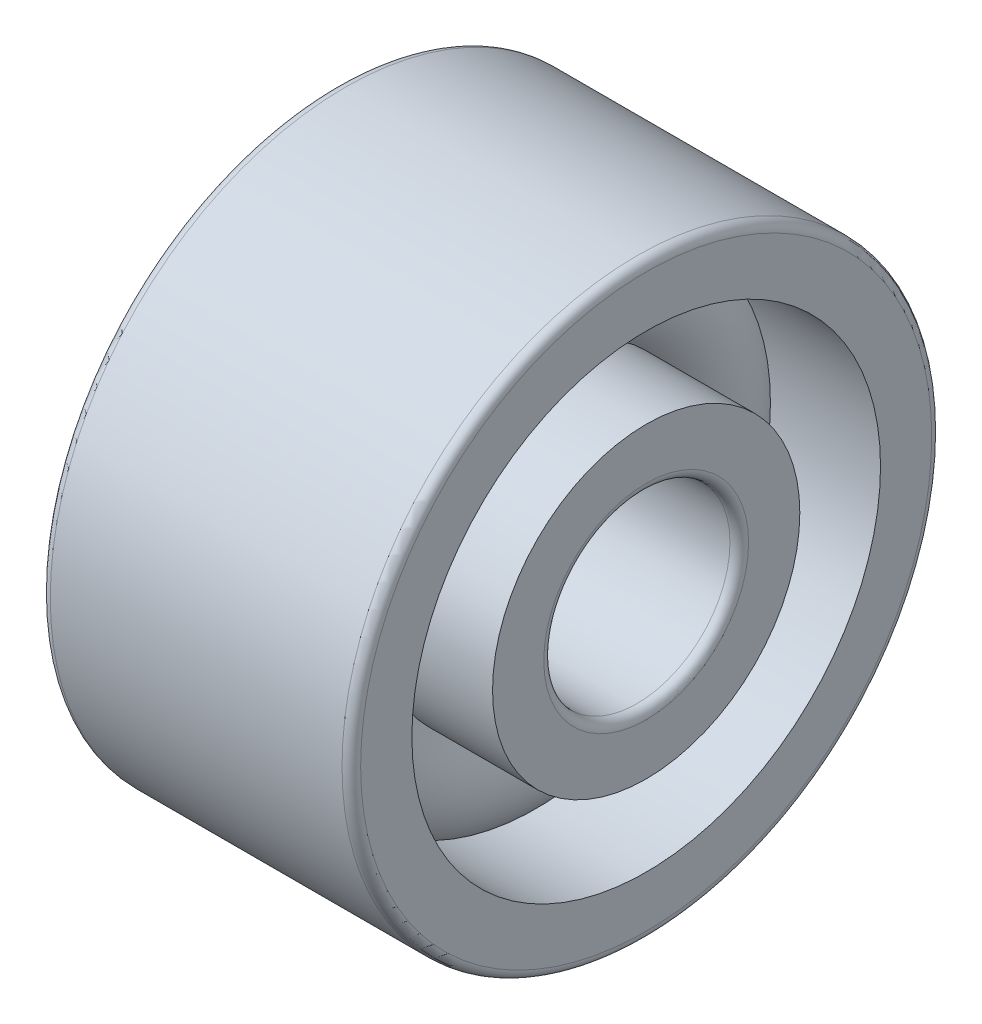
ISO-10303-21;
HEADER;
FILE_DESCRIPTION(('STEP AP214'),'2;1');
FILE_NAME('part.step','',(''),(''),'','','');
FILE_SCHEMA(('AUTOMOTIVE_DESIGN { 1 0 10303 214 1 1 1 1 }'));
ENDSEC;
DATA;
#1=APPLICATION_CONTEXT('core data for automotive mechanical design processes');
#2=APPLICATION_PROTOCOL_DEFINITION('international standard','automotive_design',2000,#1);
#3=PRODUCT_CONTEXT('',#1,'mechanical');
#4=PRODUCT('Part','Part','',(#3));
#5=PRODUCT_RELATED_PRODUCT_CATEGORY('part','',(#4));
#6=PRODUCT_DEFINITION_FORMATION('','',#4);
#7=PRODUCT_DEFINITION_CONTEXT('part definition',#1,'design');
#8=PRODUCT_DEFINITION('design','',#6,#7);
#9=PRODUCT_DEFINITION_SHAPE('','',#8);
#10=(LENGTH_UNIT() NAMED_UNIT(*) SI_UNIT(.MILLI.,.METRE.));
#11=(NAMED_UNIT(*) PLANE_ANGLE_UNIT() SI_UNIT($,.RADIAN.));
#12=(NAMED_UNIT(*) SI_UNIT($,.STERADIAN.) SOLID_ANGLE_UNIT());
#13=UNCERTAINTY_MEASURE_WITH_UNIT(LENGTH_MEASURE(1.E-05),#10,'distance_accuracy_value','');
#14=(GEOMETRIC_REPRESENTATION_CONTEXT(3) GLOBAL_UNCERTAINTY_ASSIGNED_CONTEXT((#13)) GLOBAL_UNIT_ASSIGNED_CONTEXT((#10,
#11,#12)) REPRESENTATION_CONTEXT('',''));
#15=CARTESIAN_POINT('',(0.,0.,0.));
#16=DIRECTION('',(0.,0.,1.));
#17=DIRECTION('',(1.,0.,0.));
#18=AXIS2_PLACEMENT_3D('',#15,#16,#17);
#19=CARTESIAN_POINT('',(0.,0.,0.));
#20=DIRECTION('',(-1.,0.,0.));
#21=DIRECTION('',(0.,0.,1.));
#22=AXIS2_PLACEMENT_3D('',#19,#20,#21);
#23=TOROIDAL_SURFACE('',#22,6.25,1.95);
#24=CARTESIAN_POINT('',(1.45344418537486,0.,0.));
#25=DIRECTION('',(-1.,0.,0.));
#26=DIRECTION('',(0.,0.,1.));
#27=AXIS2_PLACEMENT_3D('',#24,#25,#26);
#28=CIRCLE('',#27,7.55);
#29=CARTESIAN_POINT('',(1.45344418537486,0.,7.55));
#30=VERTEX_POINT('',#29);
#31=EDGE_CURVE('E36',#30,#30,#28,.F.);
#32=ORIENTED_EDGE('',*,*,#31,.T.);
#33=EDGE_LOOP('',(#32));
#34=FACE_BOUND('',#33,.T.);
#35=CARTESIAN_POINT('',(1.45344418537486,0.,0.));
#36=DIRECTION('',(-1.,0.,0.));
#37=DIRECTION('',(0.,0.,1.));
#38=AXIS2_PLACEMENT_3D('',#35,#36,#37);
#39=CIRCLE('',#38,4.95);
#40=CARTESIAN_POINT('',(1.45344418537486,0.,4.95));
#41=VERTEX_POINT('',#40);
#42=EDGE_CURVE('E10',#41,#41,#39,.T.);
#43=ORIENTED_EDGE('',*,*,#42,.T.);
#44=EDGE_LOOP('',(#43));
#45=FACE_BOUND('',#44,.T.);
#46=ADVANCED_FACE('F32',(#34,#45),#23,.T.);
#47=CARTESIAN_POINT('',(-20.6375,0.,0.));
#48=DIRECTION('',(1.,0.,0.));
#49=DIRECTION('',(0.,0.,-1.));
#50=AXIS2_PLACEMENT_3D('',#47,#48,#49);
#51=CYLINDRICAL_SURFACE('',#50,4.95);
#52=CARTESIAN_POINT('',(5.,0.,0.));
#53=DIRECTION('',(1.,0.,0.));
#54=DIRECTION('',(0.,0.,-1.));
#55=AXIS2_PLACEMENT_3D('',#52,#53,#54);
#56=CIRCLE('',#55,4.95);
#57=CARTESIAN_POINT('',(5.,0.,-4.95));
#58=VERTEX_POINT('',#57);
#59=EDGE_CURVE('E45',#58,#58,#56,.T.);
#60=ORIENTED_EDGE('',*,*,#59,.F.);
#61=EDGE_LOOP('',(#60));
#62=FACE_BOUND('',#61,.T.);
#63=ORIENTED_EDGE('',*,*,#42,.F.);
#64=EDGE_LOOP('',(#63));
#65=FACE_BOUND('',#64,.T.);
#66=ADVANCED_FACE('F84',(#62,#65),#51,.T.);
#67=CARTESIAN_POINT('',(-20.6375,0.,0.));
#68=DIRECTION('',(1.,0.,0.));
#69=DIRECTION('',(0.,0.,-1.));
#70=AXIS2_PLACEMENT_3D('',#67,#68,#69);
#71=CYLINDRICAL_SURFACE('',#70,4.95);
#72=CARTESIAN_POINT('',(-5.,0.,0.));
#73=DIRECTION('',(1.,0.,0.));
#74=DIRECTION('',(0.,0.,-1.));
#75=AXIS2_PLACEMENT_3D('',#72,#73,#74);
#76=CIRCLE('',#75,4.95);
#77=CARTESIAN_POINT('',(-5.,0.,-4.95));
#78=VERTEX_POINT('',#77);
#79=EDGE_CURVE('E54',#78,#78,#76,.T.);
#80=ORIENTED_EDGE('',*,*,#79,.T.);
#81=EDGE_LOOP('',(#80));
#82=FACE_BOUND('',#81,.T.);
#83=CARTESIAN_POINT('',(-1.45344418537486,0.,0.));
#84=DIRECTION('',(1.,0.,0.));
#85=DIRECTION('',(0.,0.,-1.));
#86=AXIS2_PLACEMENT_3D('',#83,#84,#85);
#87=CIRCLE('',#86,4.95);
#88=CARTESIAN_POINT('',(-1.45344418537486,0.,-4.95));
#89=VERTEX_POINT('',#88);
#90=EDGE_CURVE('E40',#89,#89,#87,.T.);
#91=ORIENTED_EDGE('',*,*,#90,.F.);
#92=EDGE_LOOP('',(#91));
#93=FACE_BOUND('',#92,.T.);
#94=ADVANCED_FACE('F87',(#82,#93),#71,.T.);
#95=CARTESIAN_POINT('',(5.,3.3,0.));
#96=DIRECTION('',(1.,0.,0.));
#97=DIRECTION('',(0.,0.,-1.));
#98=AXIS2_PLACEMENT_3D('',#95,#96,#97);
#99=PLANE('',#98);
#100=ORIENTED_EDGE('',*,*,#59,.T.);
#101=EDGE_LOOP('',(#100));
#102=FACE_BOUND('',#101,.T.);
#103=CARTESIAN_POINT('',(5.,0.,0.));
#104=DIRECTION('',(1.,0.,0.));
#105=DIRECTION('',(0.,0.,-1.));
#106=AXIS2_PLACEMENT_3D('',#103,#104,#105);
#107=CIRCLE('',#106,3.3);
#108=CARTESIAN_POINT('',(5.,0.,-3.3));
#109=VERTEX_POINT('',#108);
#110=EDGE_CURVE('E76',#109,#109,#107,.T.);
#111=ORIENTED_EDGE('',*,*,#110,.F.);
#112=EDGE_LOOP('',(#111));
#113=FACE_BOUND('',#112,.T.);
#114=ADVANCED_FACE('F81',(#102,#113),#99,.T.);
#115=CARTESIAN_POINT('',(4.7,0.,0.));
#116=DIRECTION('',(1.,0.,0.));
#117=DIRECTION('',(0.,0.,-1.));
#118=AXIS2_PLACEMENT_3D('',#115,#116,#117);
#119=TOROIDAL_SURFACE('',#118,3.3,0.3);
#120=ORIENTED_EDGE('',*,*,#110,.T.);
#121=EDGE_LOOP('',(#120));
#122=FACE_BOUND('',#121,.T.);
#123=CARTESIAN_POINT('',(4.7,0.,0.));
#124=DIRECTION('',(1.,0.,0.));
#125=DIRECTION('',(0.,0.,-1.));
#126=AXIS2_PLACEMENT_3D('',#123,#124,#125);
#127=CIRCLE('',#126,3.);
#128=CARTESIAN_POINT('',(4.7,0.,-3.));
#129=VERTEX_POINT('',#128);
#130=EDGE_CURVE('E73',#129,#129,#127,.T.);
#131=ORIENTED_EDGE('',*,*,#130,.F.);
#132=EDGE_LOOP('',(#131));
#133=FACE_BOUND('',#132,.T.);
#134=ADVANCED_FACE('F98',(#122,#133),#119,.T.);
#135=CARTESIAN_POINT('',(-20.6375,0.,0.));
#136=DIRECTION('',(1.,0.,0.));
#137=DIRECTION('',(0.,0.,-1.));
#138=AXIS2_PLACEMENT_3D('',#135,#136,#137);
#139=CYLINDRICAL_SURFACE('',#138,3.);
#140=ORIENTED_EDGE('',*,*,#130,.T.);
#141=EDGE_LOOP('',(#140));
#142=FACE_BOUND('',#141,.T.);
#143=CARTESIAN_POINT('',(-4.7,0.,0.));
#144=DIRECTION('',(1.,0.,0.));
#145=DIRECTION('',(0.,0.,-1.));
#146=AXIS2_PLACEMENT_3D('',#143,#144,#145);
#147=CIRCLE('',#146,3.);
#148=CARTESIAN_POINT('',(-4.7,0.,-3.));
#149=VERTEX_POINT('',#148);
#150=EDGE_CURVE('E70',#149,#149,#147,.T.);
#151=ORIENTED_EDGE('',*,*,#150,.F.);
#152=EDGE_LOOP('',(#151));
#153=FACE_BOUND('',#152,.T.);
#154=ADVANCED_FACE('F101',(#142,#153),#139,.F.);
#155=CARTESIAN_POINT('',(-4.7,0.,0.));
#156=DIRECTION('',(1.,0.,0.));
#157=DIRECTION('',(0.,0.,-1.));
#158=AXIS2_PLACEMENT_3D('',#155,#156,#157);
#159=TOROIDAL_SURFACE('',#158,3.3,0.3);
#160=ORIENTED_EDGE('',*,*,#150,.T.);
#161=EDGE_LOOP('',(#160));
#162=FACE_BOUND('',#161,.T.);
#163=CARTESIAN_POINT('',(-5.,0.,0.));
#164=DIRECTION('',(1.,0.,0.));
#165=DIRECTION('',(0.,0.,-1.));
#166=AXIS2_PLACEMENT_3D('',#163,#164,#165);
#167=CIRCLE('',#166,3.3);
#168=CARTESIAN_POINT('',(-5.,0.,-3.3));
#169=VERTEX_POINT('',#168);
#170=EDGE_CURVE('E67',#169,#169,#167,.T.);
#171=ORIENTED_EDGE('',*,*,#170,.F.);
#172=EDGE_LOOP('',(#171));
#173=FACE_BOUND('',#172,.T.);
#174=ADVANCED_FACE('F105',(#162,#173),#159,.T.);
#175=CARTESIAN_POINT('',(-5.,4.95,0.));
#176=DIRECTION('',(-1.,0.,0.));
#177=DIRECTION('',(0.,0.,1.));
#178=AXIS2_PLACEMENT_3D('',#175,#176,#177);
#179=PLANE('',#178);
#180=ORIENTED_EDGE('',*,*,#170,.T.);
#181=EDGE_LOOP('',(#180));
#182=FACE_BOUND('',#181,.T.);
#183=ORIENTED_EDGE('',*,*,#79,.F.);
#184=EDGE_LOOP('',(#183));
#185=FACE_BOUND('',#184,.T.);
#186=ADVANCED_FACE('F109',(#182,#185),#179,.T.);
#187=CARTESIAN_POINT('',(-1.45344418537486,0.,0.));
#188=DIRECTION('',(1.,0.,0.));
#189=DIRECTION('',(0.,0.,-1.));
#190=AXIS2_PLACEMENT_3D('',#187,#188,#189);
#191=CIRCLE('',#190,7.55);
#192=CARTESIAN_POINT('',(-1.45344418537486,0.,-7.55));
#193=VERTEX_POINT('',#192);
#194=EDGE_CURVE('E48',#193,#193,#191,.F.);
#195=ORIENTED_EDGE('',*,*,#194,.T.);
#196=EDGE_LOOP('',(#195));
#197=FACE_BOUND('',#196,.T.);
#198=ORIENTED_EDGE('',*,*,#90,.T.);
#199=EDGE_LOOP('',(#198));
#200=FACE_BOUND('',#199,.T.);
#201=ADVANCED_FACE('F34',(#197,#200),#23,.T.);
#202=CARTESIAN_POINT('',(-20.6375,0.,0.));
#203=DIRECTION('',(1.,0.,0.));
#204=DIRECTION('',(0.,0.,-1.));
#205=AXIS2_PLACEMENT_3D('',#202,#203,#204);
#206=CYLINDRICAL_SURFACE('',#205,7.55);
#207=CARTESIAN_POINT('',(5.,0.,0.));
#208=DIRECTION('',(1.,0.,0.));
#209=DIRECTION('',(0.,0.,-1.));
#210=AXIS2_PLACEMENT_3D('',#207,#208,#209);
#211=CIRCLE('',#210,7.55);
#212=CARTESIAN_POINT('',(5.,0.,-7.55));
#213=VERTEX_POINT('',#212);
#214=EDGE_CURVE('E50',#213,#213,#211,.T.);
#215=ORIENTED_EDGE('',*,*,#214,.T.);
#216=EDGE_LOOP('',(#215));
#217=FACE_BOUND('',#216,.T.);
#218=ORIENTED_EDGE('',*,*,#31,.F.);
#219=EDGE_LOOP('',(#218));
#220=FACE_BOUND('',#219,.T.);
#221=ADVANCED_FACE('F114',(#217,#220),#206,.F.);
#222=CARTESIAN_POINT('',(-20.6375,0.,0.));
#223=DIRECTION('',(1.,0.,0.));
#224=DIRECTION('',(0.,0.,-1.));
#225=AXIS2_PLACEMENT_3D('',#222,#223,#224);
#226=CYLINDRICAL_SURFACE('',#225,7.55);
#227=CARTESIAN_POINT('',(-5.,0.,0.));
#228=DIRECTION('',(1.,0.,0.));
#229=DIRECTION('',(0.,0.,-1.));
#230=AXIS2_PLACEMENT_3D('',#227,#228,#229);
#231=CIRCLE('',#230,7.55);
#232=CARTESIAN_POINT('',(-5.,0.,-7.55));
#233=VERTEX_POINT('',#232);
#234=EDGE_CURVE('E145',#233,#233,#231,.T.);
#235=ORIENTED_EDGE('',*,*,#234,.F.);
#236=EDGE_LOOP('',(#235));
#237=FACE_BOUND('',#236,.T.);
#238=ORIENTED_EDGE('',*,*,#194,.F.);
#239=EDGE_LOOP('',(#238));
#240=FACE_BOUND('',#239,.T.);
#241=ADVANCED_FACE('F117',(#237,#240),#226,.F.);
#242=CARTESIAN_POINT('',(5.,9.2,0.));
#243=DIRECTION('',(1.,0.,0.));
#244=DIRECTION('',(0.,0.,-1.));
#245=AXIS2_PLACEMENT_3D('',#242,#243,#244);
#246=PLANE('',#245);
#247=CARTESIAN_POINT('',(5.,0.,0.));
#248=DIRECTION('',(1.,0.,0.));
#249=DIRECTION('',(0.,0.,-1.));
#250=AXIS2_PLACEMENT_3D('',#247,#248,#249);
#251=CIRCLE('',#250,9.2);
#252=CARTESIAN_POINT('',(5.,0.,-9.2));
#253=VERTEX_POINT('',#252);
#254=EDGE_CURVE('E56',#253,#253,#251,.T.);
#255=ORIENTED_EDGE('',*,*,#254,.T.);
#256=EDGE_LOOP('',(#255));
#257=FACE_BOUND('',#256,.T.);
#258=ORIENTED_EDGE('',*,*,#214,.F.);
#259=EDGE_LOOP('',(#258));
#260=FACE_BOUND('',#259,.T.);
#261=ADVANCED_FACE('F118',(#257,#260),#246,.T.);
#262=CARTESIAN_POINT('',(4.7,0.,0.));
#263=DIRECTION('',(1.,0.,0.));
#264=DIRECTION('',(0.,0.,-1.));
#265=AXIS2_PLACEMENT_3D('',#262,#263,#264);
#266=TOROIDAL_SURFACE('',#265,9.2,0.299999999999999);
#267=CARTESIAN_POINT('',(4.7,0.,0.));
#268=DIRECTION('',(1.,0.,0.));
#269=DIRECTION('',(0.,0.,-1.));
#270=AXIS2_PLACEMENT_3D('',#267,#268,#269);
#271=CIRCLE('',#270,9.5);
#272=CARTESIAN_POINT('',(4.7,0.,-9.5));
#273=VERTEX_POINT('',#272);
#274=EDGE_CURVE('E61',#273,#273,#271,.T.);
#275=ORIENTED_EDGE('',*,*,#274,.T.);
#276=EDGE_LOOP('',(#275));
#277=FACE_BOUND('',#276,.T.);
#278=ORIENTED_EDGE('',*,*,#254,.F.);
#279=EDGE_LOOP('',(#278));
#280=FACE_BOUND('',#279,.T.);
#281=ADVANCED_FACE('F121',(#277,#280),#266,.T.);
#282=CARTESIAN_POINT('',(-20.6375,0.,0.));
#283=DIRECTION('',(1.,0.,0.));
#284=DIRECTION('',(0.,0.,-1.));
#285=AXIS2_PLACEMENT_3D('',#282,#283,#284);
#286=CYLINDRICAL_SURFACE('',#285,9.5);
#287=CARTESIAN_POINT('',(-4.7,0.,0.));
#288=DIRECTION('',(1.,0.,0.));
#289=DIRECTION('',(0.,0.,-1.));
#290=AXIS2_PLACEMENT_3D('',#287,#288,#289);
#291=CIRCLE('',#290,9.5);
#292=CARTESIAN_POINT('',(-4.7,0.,-9.5));
#293=VERTEX_POINT('',#292);
#294=EDGE_CURVE('E149',#293,#293,#291,.T.);
#295=ORIENTED_EDGE('',*,*,#294,.T.);
#296=EDGE_LOOP('',(#295));
#297=FACE_BOUND('',#296,.T.);
#298=ORIENTED_EDGE('',*,*,#274,.F.);
#299=EDGE_LOOP('',(#298));
#300=FACE_BOUND('',#299,.T.);
#301=ADVANCED_FACE('F125',(#297,#300),#286,.T.);
#302=CARTESIAN_POINT('',(-4.7,0.,0.));
#303=DIRECTION('',(1.,0.,0.));
#304=DIRECTION('',(0.,0.,-1.));
#305=AXIS2_PLACEMENT_3D('',#302,#303,#304);
#306=TOROIDAL_SURFACE('',#305,9.2,0.299999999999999);
#307=CARTESIAN_POINT('',(-5.,0.,0.));
#308=DIRECTION('',(1.,0.,0.));
#309=DIRECTION('',(0.,0.,-1.));
#310=AXIS2_PLACEMENT_3D('',#307,#308,#309);
#311=CIRCLE('',#310,9.2);
#312=CARTESIAN_POINT('',(-5.,0.,-9.2));
#313=VERTEX_POINT('',#312);
#314=EDGE_CURVE('E146',#313,#313,#311,.T.);
#315=ORIENTED_EDGE('',*,*,#314,.T.);
#316=EDGE_LOOP('',(#315));
#317=FACE_BOUND('',#316,.T.);
#318=ORIENTED_EDGE('',*,*,#294,.F.);
#319=EDGE_LOOP('',(#318));
#320=FACE_BOUND('',#319,.T.);
#321=ADVANCED_FACE('F129',(#317,#320),#306,.T.);
#322=CARTESIAN_POINT('',(-5.,7.55,0.));
#323=DIRECTION('',(-1.,0.,0.));
#324=DIRECTION('',(0.,0.,1.));
#325=AXIS2_PLACEMENT_3D('',#322,#323,#324);
#326=PLANE('',#325);
#327=ORIENTED_EDGE('',*,*,#234,.T.);
#328=EDGE_LOOP('',(#327));
#329=FACE_BOUND('',#328,.T.);
#330=ORIENTED_EDGE('',*,*,#314,.F.);
#331=EDGE_LOOP('',(#330));
#332=FACE_BOUND('',#331,.T.);
#333=ADVANCED_FACE('F133',(#329,#332),#326,.T.);
#334=CLOSED_SHELL('',(#46,#66,#94,#114,#134,#154,#174,#186,#201,#221,#241,#261,#281,#301,#321,#333));
#335=MANIFOLD_SOLID_BREP('B2',#334);
#336=ADVANCED_BREP_SHAPE_REPRESENTATION('',(#18,#335),#14);
#337=SHAPE_DEFINITION_REPRESENTATION(#9,#336);
ENDSEC;
END-ISO-10303-21;
